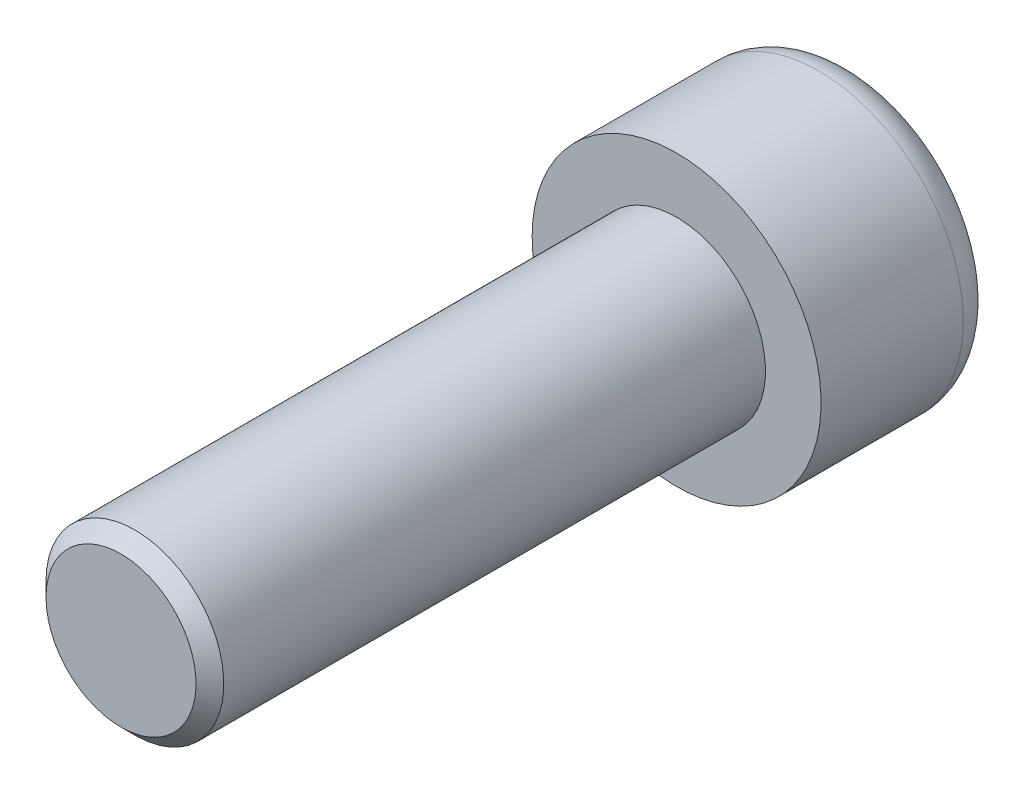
ISO-10303-21;
HEADER;
FILE_DESCRIPTION(('STEP AP214'),'2;1');
FILE_NAME('part.step','',(''),(''),'','','');
FILE_SCHEMA(('AUTOMOTIVE_DESIGN { 1 0 10303 214 1 1 1 1 }'));
ENDSEC;
DATA;
#1=APPLICATION_CONTEXT('core data for automotive mechanical design processes');
#2=APPLICATION_PROTOCOL_DEFINITION('international standard','automotive_design',2000,#1);
#3=PRODUCT_CONTEXT('',#1,'mechanical');
#4=PRODUCT('Part','Part','',(#3));
#5=PRODUCT_RELATED_PRODUCT_CATEGORY('part','',(#4));
#6=PRODUCT_DEFINITION_FORMATION('','',#4);
#7=PRODUCT_DEFINITION_CONTEXT('part definition',#1,'design');
#8=PRODUCT_DEFINITION('design','',#6,#7);
#9=PRODUCT_DEFINITION_SHAPE('','',#8);
#10=(LENGTH_UNIT() NAMED_UNIT(*) SI_UNIT(.MILLI.,.METRE.));
#11=(NAMED_UNIT(*) PLANE_ANGLE_UNIT() SI_UNIT($,.RADIAN.));
#12=(NAMED_UNIT(*) SI_UNIT($,.STERADIAN.) SOLID_ANGLE_UNIT());
#13=UNCERTAINTY_MEASURE_WITH_UNIT(LENGTH_MEASURE(1.E-05),#10,'distance_accuracy_value','');
#14=(GEOMETRIC_REPRESENTATION_CONTEXT(3) GLOBAL_UNCERTAINTY_ASSIGNED_CONTEXT((#13)) GLOBAL_UNIT_ASSIGNED_CONTEXT((#10,
#11,#12)) REPRESENTATION_CONTEXT('',''));
#15=CARTESIAN_POINT('',(0.,0.,0.));
#16=DIRECTION('',(0.,0.,1.));
#17=DIRECTION('',(1.,0.,0.));
#18=AXIS2_PLACEMENT_3D('',#15,#16,#17);
#19=CARTESIAN_POINT('',(-3.,1.73205080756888,5.));
#20=DIRECTION('',(0.,0.,1.));
#21=DIRECTION('',(1.,0.,0.));
#22=AXIS2_PLACEMENT_3D('',#19,#20,#21);
#23=PLANE('',#22);
#24=DIRECTION('',(-0.866025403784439,0.499999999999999,0.));
#25=VECTOR('',#24,1.);
#26=CARTESIAN_POINT('',(0.,3.46410161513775,5.));
#27=LINE('',#26,#25);
#28=CARTESIAN_POINT('',(0.,3.46410161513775,5.));
#29=VERTEX_POINT('',#28);
#30=CARTESIAN_POINT('',(3.,1.73205080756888,5.));
#31=VERTEX_POINT('',#30);
#32=EDGE_CURVE('E65',#29,#31,#27,.F.);
#33=ORIENTED_EDGE('',*,*,#32,.T.);
#34=DIRECTION('',(0.,1.,0.));
#35=VECTOR('',#34,1.);
#36=CARTESIAN_POINT('',(3.,1.73205080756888,5.));
#37=LINE('',#36,#35);
#38=CARTESIAN_POINT('',(3.,-1.73205080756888,5.));
#39=VERTEX_POINT('',#38);
#40=EDGE_CURVE('E62',#31,#39,#37,.F.);
#41=ORIENTED_EDGE('',*,*,#40,.T.);
#42=DIRECTION('',(0.866025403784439,0.499999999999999,0.));
#43=VECTOR('',#42,1.);
#44=CARTESIAN_POINT('',(3.,-1.73205080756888,5.));
#45=LINE('',#44,#43);
#46=CARTESIAN_POINT('',(0.,-3.46410161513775,5.));
#47=VERTEX_POINT('',#46);
#48=EDGE_CURVE('E59',#39,#47,#45,.F.);
#49=ORIENTED_EDGE('',*,*,#48,.T.);
#50=DIRECTION('',(0.866025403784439,-0.499999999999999,0.));
#51=VECTOR('',#50,1.);
#52=CARTESIAN_POINT('',(-3.,-1.73205080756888,5.));
#53=LINE('',#52,#51);
#54=CARTESIAN_POINT('',(-3.,-1.73205080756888,5.));
#55=VERTEX_POINT('',#54);
#56=EDGE_CURVE('E86',#47,#55,#53,.F.);
#57=ORIENTED_EDGE('',*,*,#56,.T.);
#58=DIRECTION('',(0.,1.,0.));
#59=VECTOR('',#58,1.);
#60=CARTESIAN_POINT('',(-3.,1.73205080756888,5.));
#61=LINE('',#60,#59);
#62=CARTESIAN_POINT('',(-3.,1.73205080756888,5.));
#63=VERTEX_POINT('',#62);
#64=EDGE_CURVE('E284',#55,#63,#61,.T.);
#65=ORIENTED_EDGE('',*,*,#64,.T.);
#66=DIRECTION('',(-0.866025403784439,-0.499999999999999,0.));
#67=VECTOR('',#66,1.);
#68=CARTESIAN_POINT('',(0.,3.46410161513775,5.));
#69=LINE('',#68,#67);
#70=EDGE_CURVE('E291',#63,#29,#69,.F.);
#71=ORIENTED_EDGE('',*,*,#70,.T.);
#72=EDGE_LOOP('',(#33,#41,#49,#57,#65,#71));
#73=FACE_BOUND('',#72,.T.);
#74=ADVANCED_FACE('F16',(#73),#23,.F.);
#75=CARTESIAN_POINT('',(3.,1.73205080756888,5.));
#76=DIRECTION('',(1.,0.,0.));
#77=DIRECTION('',(0.,0.,-1.));
#78=AXIS2_PLACEMENT_3D('',#75,#76,#77);
#79=PLANE('',#78);
#80=DIRECTION('',(0.,0.,1.));
#81=VECTOR('',#80,1.);
#82=CARTESIAN_POINT('',(3.,-1.73205080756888,5.));
#83=LINE('',#82,#81);
#84=CARTESIAN_POINT('',(3.,-1.73205080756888,0.));
#85=VERTEX_POINT('',#84);
#86=EDGE_CURVE('E69',#85,#39,#83,.T.);
#87=ORIENTED_EDGE('',*,*,#86,.T.);
#88=ORIENTED_EDGE('',*,*,#40,.F.);
#89=DIRECTION('',(0.,0.,1.));
#90=VECTOR('',#89,1.);
#91=CARTESIAN_POINT('',(3.,1.73205080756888,5.));
#92=LINE('',#91,#90);
#93=CARTESIAN_POINT('',(3.,1.73205080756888,0.));
#94=VERTEX_POINT('',#93);
#95=EDGE_CURVE('E122',#31,#94,#92,.F.);
#96=ORIENTED_EDGE('',*,*,#95,.T.);
#97=DIRECTION('',(0.,1.,0.));
#98=VECTOR('',#97,1.);
#99=CARTESIAN_POINT('',(3.,0.,0.));
#100=LINE('',#99,#98);
#101=EDGE_CURVE('E76',#94,#85,#100,.F.);
#102=ORIENTED_EDGE('',*,*,#101,.T.);
#103=EDGE_LOOP('',(#87,#88,#96,#102));
#104=FACE_BOUND('',#103,.T.);
#105=ADVANCED_FACE('F73',(#104),#79,.F.);
#106=CARTESIAN_POINT('',(3.,-1.73205080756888,5.));
#107=DIRECTION('',(0.499999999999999,-0.866025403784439,0.));
#108=DIRECTION('',(0.866025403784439,0.499999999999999,0.));
#109=AXIS2_PLACEMENT_3D('',#106,#107,#108);
#110=PLANE('',#109);
#111=DIRECTION('',(0.,0.,1.));
#112=VECTOR('',#111,1.);
#113=CARTESIAN_POINT('',(0.,-3.46410161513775,5.));
#114=LINE('',#113,#112);
#115=CARTESIAN_POINT('',(0.,-3.46410161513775,0.));
#116=VERTEX_POINT('',#115);
#117=EDGE_CURVE('E83',#116,#47,#114,.T.);
#118=ORIENTED_EDGE('',*,*,#117,.T.);
#119=ORIENTED_EDGE('',*,*,#48,.F.);
#120=ORIENTED_EDGE('',*,*,#86,.F.);
#121=DIRECTION('',(-0.866025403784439,-0.499999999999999,0.));
#122=VECTOR('',#121,1.);
#123=CARTESIAN_POINT('',(3.,-1.73205080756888,0.));
#124=LINE('',#123,#122);
#125=EDGE_CURVE('E120',#85,#116,#124,.T.);
#126=ORIENTED_EDGE('',*,*,#125,.T.);
#127=EDGE_LOOP('',(#118,#119,#120,#126));
#128=FACE_BOUND('',#127,.T.);
#129=ADVANCED_FACE('F81',(#128),#110,.F.);
#130=CARTESIAN_POINT('',(-3.,-1.73205080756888,5.));
#131=DIRECTION('',(-0.499999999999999,-0.866025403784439,0.));
#132=DIRECTION('',(0.866025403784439,-0.499999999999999,0.));
#133=AXIS2_PLACEMENT_3D('',#130,#131,#132);
#134=PLANE('',#133);
#135=DIRECTION('',(0.,0.,1.));
#136=VECTOR('',#135,1.);
#137=CARTESIAN_POINT('',(-3.,-1.73205080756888,5.));
#138=LINE('',#137,#136);
#139=CARTESIAN_POINT('',(-3.,-1.73205080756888,0.));
#140=VERTEX_POINT('',#139);
#141=EDGE_CURVE('E279',#140,#55,#138,.T.);
#142=ORIENTED_EDGE('',*,*,#141,.T.);
#143=ORIENTED_EDGE('',*,*,#56,.F.);
#144=ORIENTED_EDGE('',*,*,#117,.F.);
#145=DIRECTION('',(-0.866025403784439,0.499999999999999,0.));
#146=VECTOR('',#145,1.);
#147=CARTESIAN_POINT('',(0.,-3.46410161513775,0.));
#148=LINE('',#147,#146);
#149=EDGE_CURVE('E117',#116,#140,#148,.T.);
#150=ORIENTED_EDGE('',*,*,#149,.T.);
#151=EDGE_LOOP('',(#142,#143,#144,#150));
#152=FACE_BOUND('',#151,.T.);
#153=ADVANCED_FACE('F234',(#152),#134,.F.);
#154=CARTESIAN_POINT('',(-3.,1.73205080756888,5.));
#155=DIRECTION('',(-1.,0.,0.));
#156=DIRECTION('',(0.,0.,1.));
#157=AXIS2_PLACEMENT_3D('',#154,#155,#156);
#158=PLANE('',#157);
#159=DIRECTION('',(0.,0.,1.));
#160=VECTOR('',#159,1.);
#161=CARTESIAN_POINT('',(-3.,1.73205080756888,5.));
#162=LINE('',#161,#160);
#163=CARTESIAN_POINT('',(-3.,1.73205080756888,0.));
#164=VERTEX_POINT('',#163);
#165=EDGE_CURVE('E288',#164,#63,#162,.T.);
#166=ORIENTED_EDGE('',*,*,#165,.T.);
#167=ORIENTED_EDGE('',*,*,#64,.F.);
#168=ORIENTED_EDGE('',*,*,#141,.F.);
#169=DIRECTION('',(0.,1.,0.));
#170=VECTOR('',#169,1.);
#171=CARTESIAN_POINT('',(-3.,0.,0.));
#172=LINE('',#171,#170);
#173=EDGE_CURVE('E108',#140,#164,#172,.T.);
#174=ORIENTED_EDGE('',*,*,#173,.T.);
#175=EDGE_LOOP('',(#166,#167,#168,#174));
#176=FACE_BOUND('',#175,.T.);
#177=ADVANCED_FACE('F224',(#176),#158,.F.);
#178=CARTESIAN_POINT('',(0.,3.46410161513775,5.));
#179=DIRECTION('',(-0.499999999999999,0.866025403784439,0.));
#180=DIRECTION('',(-0.866025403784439,-0.499999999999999,0.));
#181=AXIS2_PLACEMENT_3D('',#178,#179,#180);
#182=PLANE('',#181);
#183=DIRECTION('',(0.,0.,1.));
#184=VECTOR('',#183,1.);
#185=CARTESIAN_POINT('',(0.,3.46410161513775,5.));
#186=LINE('',#185,#184);
#187=CARTESIAN_POINT('',(0.,3.46410161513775,0.));
#188=VERTEX_POINT('',#187);
#189=EDGE_CURVE('E295',#188,#29,#186,.T.);
#190=ORIENTED_EDGE('',*,*,#189,.T.);
#191=ORIENTED_EDGE('',*,*,#70,.F.);
#192=ORIENTED_EDGE('',*,*,#165,.F.);
#193=DIRECTION('',(0.866025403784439,0.499999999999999,0.));
#194=VECTOR('',#193,1.);
#195=CARTESIAN_POINT('',(-3.,1.73205080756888,0.));
#196=LINE('',#195,#194);
#197=EDGE_CURVE('E102',#164,#188,#196,.T.);
#198=ORIENTED_EDGE('',*,*,#197,.T.);
#199=EDGE_LOOP('',(#190,#191,#192,#198));
#200=FACE_BOUND('',#199,.T.);
#201=ADVANCED_FACE('F163',(#200),#182,.F.);
#202=CARTESIAN_POINT('',(0.,3.46410161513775,5.));
#203=DIRECTION('',(0.499999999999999,0.866025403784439,0.));
#204=DIRECTION('',(-0.866025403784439,0.499999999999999,0.));
#205=AXIS2_PLACEMENT_3D('',#202,#203,#204);
#206=PLANE('',#205);
#207=ORIENTED_EDGE('',*,*,#95,.F.);
#208=ORIENTED_EDGE('',*,*,#32,.F.);
#209=ORIENTED_EDGE('',*,*,#189,.F.);
#210=DIRECTION('',(0.866025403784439,-0.499999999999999,0.));
#211=VECTOR('',#210,1.);
#212=CARTESIAN_POINT('',(0.,3.46410161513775,0.));
#213=LINE('',#212,#211);
#214=EDGE_CURVE('E100',#188,#94,#213,.T.);
#215=ORIENTED_EDGE('',*,*,#214,.T.);
#216=EDGE_LOOP('',(#207,#208,#209,#215));
#217=FACE_BOUND('',#216,.T.);
#218=ADVANCED_FACE('F157',(#217),#206,.F.);
#219=CARTESIAN_POINT('',(0.,0.,0.));
#220=DIRECTION('',(0.,0.,1.));
#221=DIRECTION('',(1.,0.,0.));
#222=AXIS2_PLACEMENT_3D('',#219,#220,#221);
#223=PLANE('',#222);
#224=ORIENTED_EDGE('',*,*,#197,.F.);
#225=ORIENTED_EDGE('',*,*,#173,.F.);
#226=ORIENTED_EDGE('',*,*,#149,.F.);
#227=ORIENTED_EDGE('',*,*,#125,.F.);
#228=ORIENTED_EDGE('',*,*,#101,.F.);
#229=ORIENTED_EDGE('',*,*,#214,.F.);
#230=EDGE_LOOP('',(#224,#225,#226,#227,#228,#229));
#231=FACE_BOUND('',#230,.T.);
#232=CARTESIAN_POINT('',(0.,0.,0.));
#233=DIRECTION('',(0.,0.,1.));
#234=DIRECTION('',(1.,0.,0.));
#235=AXIS2_PLACEMENT_3D('',#232,#233,#234);
#236=CIRCLE('',#235,4.9);
#237=CARTESIAN_POINT('',(4.9,0.,0.));
#238=VERTEX_POINT('',#237);
#239=CARTESIAN_POINT('',(-4.9,0.,0.));
#240=VERTEX_POINT('',#239);
#241=EDGE_CURVE('E98',#238,#240,#236,.T.);
#242=ORIENTED_EDGE('',*,*,#241,.F.);
#243=CARTESIAN_POINT('',(0.,0.,0.));
#244=DIRECTION('',(0.,0.,1.));
#245=DIRECTION('',(-1.,0.,0.));
#246=AXIS2_PLACEMENT_3D('',#243,#244,#245);
#247=CIRCLE('',#246,4.9);
#248=EDGE_CURVE('E35',#240,#238,#247,.T.);
#249=ORIENTED_EDGE('',*,*,#248,.F.);
#250=EDGE_LOOP('',(#242,#249));
#251=FACE_BOUND('',#250,.T.);
#252=ADVANCED_FACE('F138',(#231,#251),#223,.F.);
#253=CARTESIAN_POINT('',(0.,0.,1.6));
#254=DIRECTION('',(0.,0.,1.));
#255=DIRECTION('',(1.,0.,0.));
#256=AXIS2_PLACEMENT_3D('',#253,#254,#255);
#257=TOROIDAL_SURFACE('',#256,4.9,1.6);
#258=CARTESIAN_POINT('',(0.,0.,1.6));
#259=DIRECTION('',(0.,0.,-1.));
#260=DIRECTION('',(-1.,0.,0.));
#261=AXIS2_PLACEMENT_3D('',#258,#259,#260);
#262=CIRCLE('',#261,6.5);
#263=CARTESIAN_POINT('',(-6.5,0.,1.6));
#264=VERTEX_POINT('',#263);
#265=EDGE_CURVE('E95',#264,#264,#262,.F.);
#266=ORIENTED_EDGE('',*,*,#265,.F.);
#267=EDGE_LOOP('',(#266));
#268=FACE_BOUND('',#267,.T.);
#269=ORIENTED_EDGE('',*,*,#241,.T.);
#270=ORIENTED_EDGE('',*,*,#248,.T.);
#271=EDGE_LOOP('',(#269,#270));
#272=FACE_BOUND('',#271,.T.);
#273=ADVANCED_FACE('F97',(#268,#272),#257,.T.);
#274=CARTESIAN_POINT('',(0.,0.,33.));
#275=DIRECTION('',(0.,0.,1.));
#276=DIRECTION('',(1.,0.,0.));
#277=AXIS2_PLACEMENT_3D('',#274,#275,#276);
#278=PLANE('',#277);
#279=CARTESIAN_POINT('',(0.,0.,33.0000000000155));
#280=DIRECTION('',(0.,0.,-1.));
#281=DIRECTION('',(-1.,0.,0.));
#282=AXIS2_PLACEMENT_3D('',#279,#280,#281);
#283=CIRCLE('',#282,3.37499999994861);
#284=CARTESIAN_POINT('',(-3.37499999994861,0.,33.0000000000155));
#285=VERTEX_POINT('',#284);
#286=EDGE_CURVE('E93',#285,#285,#283,.T.);
#287=ORIENTED_EDGE('',*,*,#286,.F.);
#288=EDGE_LOOP('',(#287));
#289=FACE_BOUND('',#288,.T.);
#290=ADVANCED_FACE('F137',(#289),#278,.T.);
#291=CARTESIAN_POINT('',(0.,0.,8.));
#292=DIRECTION('',(0.,0.,-1.));
#293=DIRECTION('',(-1.,0.,0.));
#294=AXIS2_PLACEMENT_3D('',#291,#292,#293);
#295=CYLINDRICAL_SURFACE('',#294,6.5);
#296=ORIENTED_EDGE('',*,*,#265,.T.);
#297=EDGE_LOOP('',(#296));
#298=FACE_BOUND('',#297,.T.);
#299=CARTESIAN_POINT('',(0.,0.,8.));
#300=DIRECTION('',(0.,0.,-1.));
#301=DIRECTION('',(-1.,0.,0.));
#302=AXIS2_PLACEMENT_3D('',#299,#300,#301);
#303=CIRCLE('',#302,6.5);
#304=CARTESIAN_POINT('',(-6.5,0.,8.));
#305=VERTEX_POINT('',#304);
#306=EDGE_CURVE('E90',#305,#305,#303,.F.);
#307=ORIENTED_EDGE('',*,*,#306,.F.);
#308=EDGE_LOOP('',(#307));
#309=FACE_BOUND('',#308,.T.);
#310=ADVANCED_FACE('F179',(#298,#309),#295,.T.);
#311=CARTESIAN_POINT('',(0.,0.,32.3750000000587));
#312=DIRECTION('',(0.,0.,-1.));
#313=DIRECTION('',(-1.,0.,0.));
#314=AXIS2_PLACEMENT_3D('',#311,#312,#313);
#315=CONICAL_SURFACE('',#314,3.99999999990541,0.785398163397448);
#316=CARTESIAN_POINT('',(0.,0.,32.3749999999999));
#317=DIRECTION('',(0.,0.,-1.));
#318=DIRECTION('',(-1.,0.,0.));
#319=AXIS2_PLACEMENT_3D('',#316,#317,#318);
#320=CIRCLE('',#319,4.);
#321=CARTESIAN_POINT('',(-4.,0.,32.3749999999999));
#322=VERTEX_POINT('',#321);
#323=EDGE_CURVE('E27',#322,#322,#320,.T.);
#324=ORIENTED_EDGE('',*,*,#323,.F.);
#325=EDGE_LOOP('',(#324));
#326=FACE_BOUND('',#325,.T.);
#327=ORIENTED_EDGE('',*,*,#286,.T.);
#328=EDGE_LOOP('',(#327));
#329=FACE_BOUND('',#328,.T.);
#330=ADVANCED_FACE('F173',(#326,#329),#315,.T.);
#331=CARTESIAN_POINT('',(0.,0.,8.));
#332=DIRECTION('',(0.,0.,1.));
#333=DIRECTION('',(1.,0.,0.));
#334=AXIS2_PLACEMENT_3D('',#331,#332,#333);
#335=PLANE('',#334);
#336=CARTESIAN_POINT('',(0.,0.,8.));
#337=DIRECTION('',(0.,0.,-1.));
#338=DIRECTION('',(-1.,0.,0.));
#339=AXIS2_PLACEMENT_3D('',#336,#337,#338);
#340=CIRCLE('',#339,4.);
#341=CARTESIAN_POINT('',(-4.,0.,8.));
#342=VERTEX_POINT('',#341);
#343=EDGE_CURVE('E11',#342,#342,#340,.F.);
#344=ORIENTED_EDGE('',*,*,#343,.F.);
#345=EDGE_LOOP('',(#344));
#346=FACE_BOUND('',#345,.T.);
#347=ORIENTED_EDGE('',*,*,#306,.T.);
#348=EDGE_LOOP('',(#347));
#349=FACE_BOUND('',#348,.T.);
#350=ADVANCED_FACE('F167',(#346,#349),#335,.T.);
#351=CARTESIAN_POINT('',(0.,0.,33.));
#352=DIRECTION('',(0.,0.,-1.));
#353=DIRECTION('',(-1.,0.,0.));
#354=AXIS2_PLACEMENT_3D('',#351,#352,#353);
#355=CYLINDRICAL_SURFACE('',#354,4.);
#356=ORIENTED_EDGE('',*,*,#343,.T.);
#357=EDGE_LOOP('',(#356));
#358=FACE_BOUND('',#357,.T.);
#359=ORIENTED_EDGE('',*,*,#323,.T.);
#360=EDGE_LOOP('',(#359));
#361=FACE_BOUND('',#360,.T.);
#362=ADVANCED_FACE('F165',(#358,#361),#355,.T.);
#363=CLOSED_SHELL('',(#74,#105,#129,#153,#177,#201,#218,#252,#273,#290,#310,#330,#350,#362));
#364=MANIFOLD_SOLID_BREP('B1',#363);
#365=ADVANCED_BREP_SHAPE_REPRESENTATION('',(#18,#364),#14);
#366=SHAPE_DEFINITION_REPRESENTATION(#9,#365);
ENDSEC;
END-ISO-10303-21;
